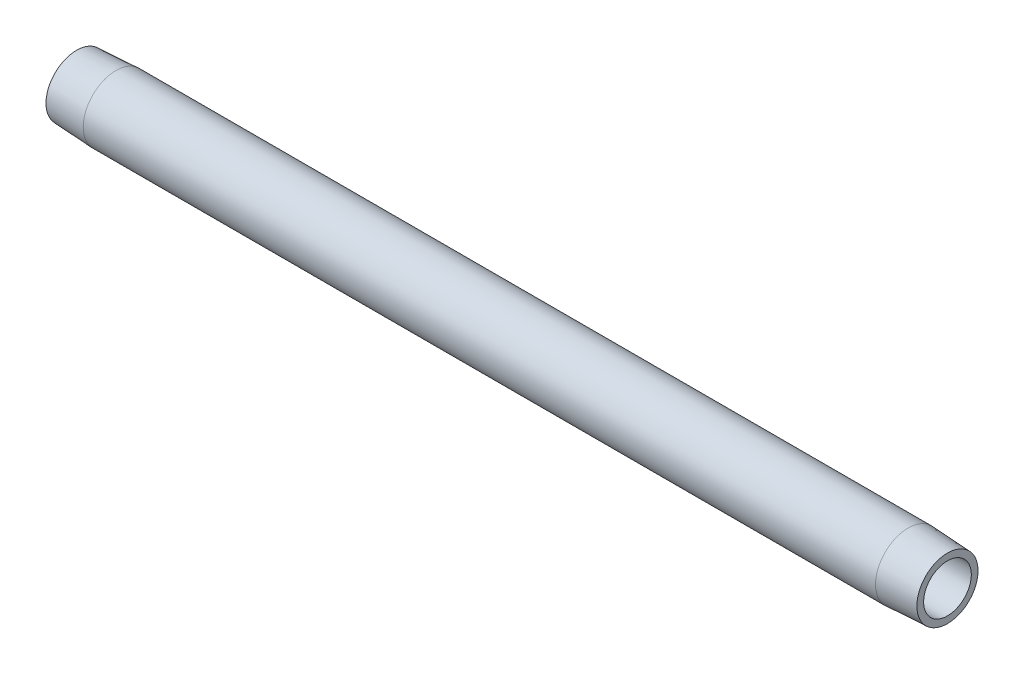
ISO-10303-21;
HEADER;
FILE_DESCRIPTION(('STEP AP214'),'2;1');
FILE_NAME('part.step','',(''),(''),'','','');
FILE_SCHEMA(('AUTOMOTIVE_DESIGN { 1 0 10303 214 1 1 1 1 }'));
ENDSEC;
DATA;
#1=APPLICATION_CONTEXT('core data for automotive mechanical design processes');
#2=APPLICATION_PROTOCOL_DEFINITION('international standard','automotive_design',2000,#1);
#3=PRODUCT_CONTEXT('',#1,'mechanical');
#4=PRODUCT('Part','Part','',(#3));
#5=PRODUCT_RELATED_PRODUCT_CATEGORY('part','',(#4));
#6=PRODUCT_DEFINITION_FORMATION('','',#4);
#7=PRODUCT_DEFINITION_CONTEXT('part definition',#1,'design');
#8=PRODUCT_DEFINITION('design','',#6,#7);
#9=PRODUCT_DEFINITION_SHAPE('','',#8);
#10=(LENGTH_UNIT() NAMED_UNIT(*) SI_UNIT(.MILLI.,.METRE.));
#11=(NAMED_UNIT(*) PLANE_ANGLE_UNIT() SI_UNIT($,.RADIAN.));
#12=(NAMED_UNIT(*) SI_UNIT($,.STERADIAN.) SOLID_ANGLE_UNIT());
#13=UNCERTAINTY_MEASURE_WITH_UNIT(LENGTH_MEASURE(1.E-05),#10,'distance_accuracy_value','');
#14=(GEOMETRIC_REPRESENTATION_CONTEXT(3) GLOBAL_UNCERTAINTY_ASSIGNED_CONTEXT((#13)) GLOBAL_UNIT_ASSIGNED_CONTEXT((#10,
#11,#12)) REPRESENTATION_CONTEXT('',''));
#15=CARTESIAN_POINT('',(0.,0.,0.));
#16=DIRECTION('',(0.,0.,1.));
#17=DIRECTION('',(1.,0.,0.));
#18=AXIS2_PLACEMENT_3D('',#15,#16,#17);
#19=CARTESIAN_POINT('',(228.6,6.26110000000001,0.));
#20=DIRECTION('',(-1.,0.,0.));
#21=DIRECTION('',(0.,0.,1.));
#22=AXIS2_PLACEMENT_3D('',#19,#20,#21);
#23=PLANE('',#22);
#24=CARTESIAN_POINT('',(228.6,0.,0.));
#25=DIRECTION('',(-1.,0.,0.));
#26=DIRECTION('',(0.,0.,1.));
#27=AXIS2_PLACEMENT_3D('',#24,#25,#26);
#28=CIRCLE('',#27,8.03205001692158);
#29=CARTESIAN_POINT('',(228.6,0.,8.03205001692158));
#30=VERTEX_POINT('',#29);
#31=EDGE_CURVE('E10',#30,#30,#28,.T.);
#32=ORIENTED_EDGE('',*,*,#31,.F.);
#33=EDGE_LOOP('',(#32));
#34=FACE_BOUND('',#33,.T.);
#35=CARTESIAN_POINT('',(228.6,0.,0.));
#36=DIRECTION('',(-1.,0.,0.));
#37=DIRECTION('',(0.,0.,1.));
#38=AXIS2_PLACEMENT_3D('',#35,#36,#37);
#39=CIRCLE('',#38,6.26110000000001);
#40=CARTESIAN_POINT('',(228.6,0.,6.26110000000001));
#41=VERTEX_POINT('',#40);
#42=EDGE_CURVE('E52',#41,#41,#39,.T.);
#43=ORIENTED_EDGE('',*,*,#42,.T.);
#44=EDGE_LOOP('',(#43));
#45=FACE_BOUND('',#44,.T.);
#46=ADVANCED_FACE('F30',(#34,#45),#23,.F.);
#47=CARTESIAN_POINT('',(228.6,0.,0.));
#48=DIRECTION('',(-1.,0.,0.));
#49=DIRECTION('',(0.,0.,1.));
#50=AXIS2_PLACEMENT_3D('',#47,#48,#49);
#51=CONICAL_SURFACE('',#50,8.03205001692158,0.0523598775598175);
#52=CARTESIAN_POINT('',(218.2876,0.,0.));
#53=DIRECTION('',(-1.,0.,0.));
#54=DIRECTION('',(0.,0.,1.));
#55=AXIS2_PLACEMENT_3D('',#52,#53,#54);
#56=CIRCLE('',#55,8.57249999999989);
#57=CARTESIAN_POINT('',(218.2876,0.,8.57249999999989));
#58=VERTEX_POINT('',#57);
#59=EDGE_CURVE('E36',#58,#58,#56,.T.);
#60=ORIENTED_EDGE('',*,*,#59,.F.);
#61=EDGE_LOOP('',(#60));
#62=FACE_BOUND('',#61,.T.);
#63=ORIENTED_EDGE('',*,*,#31,.T.);
#64=EDGE_LOOP('',(#63));
#65=FACE_BOUND('',#64,.T.);
#66=ADVANCED_FACE('F77',(#62,#65),#51,.T.);
#67=CARTESIAN_POINT('',(0.,0.,0.));
#68=DIRECTION('',(-1.,0.,0.));
#69=DIRECTION('',(0.,0.,1.));
#70=AXIS2_PLACEMENT_3D('',#67,#68,#69);
#71=CYLINDRICAL_SURFACE('',#70,8.57249999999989);
#72=CARTESIAN_POINT('',(10.3124,0.,0.));
#73=DIRECTION('',(-1.,0.,0.));
#74=DIRECTION('',(0.,0.,1.));
#75=AXIS2_PLACEMENT_3D('',#72,#73,#74);
#76=CIRCLE('',#75,8.57249999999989);
#77=CARTESIAN_POINT('',(10.3124,0.,8.57249999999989));
#78=VERTEX_POINT('',#77);
#79=EDGE_CURVE('E40',#78,#78,#76,.T.);
#80=ORIENTED_EDGE('',*,*,#79,.F.);
#81=EDGE_LOOP('',(#80));
#82=FACE_BOUND('',#81,.T.);
#83=ORIENTED_EDGE('',*,*,#59,.T.);
#84=EDGE_LOOP('',(#83));
#85=FACE_BOUND('',#84,.T.);
#86=ADVANCED_FACE('F72',(#82,#85),#71,.T.);
#87=CARTESIAN_POINT('',(10.3124,0.,0.));
#88=DIRECTION('',(1.,0.,0.));
#89=DIRECTION('',(0.,0.,-1.));
#90=AXIS2_PLACEMENT_3D('',#87,#88,#89);
#91=CONICAL_SURFACE('',#90,8.57249999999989,0.0523598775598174);
#92=CARTESIAN_POINT('',(0.,0.,0.));
#93=DIRECTION('',(-1.,0.,0.));
#94=DIRECTION('',(0.,0.,1.));
#95=AXIS2_PLACEMENT_3D('',#92,#93,#94);
#96=CIRCLE('',#95,8.03205001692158);
#97=CARTESIAN_POINT('',(0.,0.,8.03205001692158));
#98=VERTEX_POINT('',#97);
#99=EDGE_CURVE('E44',#98,#98,#96,.T.);
#100=ORIENTED_EDGE('',*,*,#99,.F.);
#101=EDGE_LOOP('',(#100));
#102=FACE_BOUND('',#101,.T.);
#103=ORIENTED_EDGE('',*,*,#79,.T.);
#104=EDGE_LOOP('',(#103));
#105=FACE_BOUND('',#104,.T.);
#106=ADVANCED_FACE('F66',(#102,#105),#91,.T.);
#107=CARTESIAN_POINT('',(0.,6.26110000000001,0.));
#108=DIRECTION('',(1.,0.,0.));
#109=DIRECTION('',(0.,0.,-1.));
#110=AXIS2_PLACEMENT_3D('',#107,#108,#109);
#111=PLANE('',#110);
#112=CARTESIAN_POINT('',(0.,0.,0.));
#113=DIRECTION('',(-1.,0.,0.));
#114=DIRECTION('',(0.,0.,1.));
#115=AXIS2_PLACEMENT_3D('',#112,#113,#114);
#116=CIRCLE('',#115,6.26110000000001);
#117=CARTESIAN_POINT('',(0.,0.,6.26110000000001));
#118=VERTEX_POINT('',#117);
#119=EDGE_CURVE('E49',#118,#118,#116,.T.);
#120=ORIENTED_EDGE('',*,*,#119,.F.);
#121=EDGE_LOOP('',(#120));
#122=FACE_BOUND('',#121,.T.);
#123=ORIENTED_EDGE('',*,*,#99,.T.);
#124=EDGE_LOOP('',(#123));
#125=FACE_BOUND('',#124,.T.);
#126=ADVANCED_FACE('F60',(#122,#125),#111,.F.);
#127=CARTESIAN_POINT('',(0.,0.,0.));
#128=DIRECTION('',(-1.,0.,0.));
#129=DIRECTION('',(0.,0.,1.));
#130=AXIS2_PLACEMENT_3D('',#127,#128,#129);
#131=CYLINDRICAL_SURFACE('',#130,6.26110000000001);
#132=ORIENTED_EDGE('',*,*,#42,.F.);
#133=EDGE_LOOP('',(#132));
#134=FACE_BOUND('',#133,.T.);
#135=ORIENTED_EDGE('',*,*,#119,.T.);
#136=EDGE_LOOP('',(#135));
#137=FACE_BOUND('',#136,.T.);
#138=ADVANCED_FACE('F57',(#134,#137),#131,.F.);
#139=CLOSED_SHELL('',(#46,#66,#86,#106,#126,#138));
#140=MANIFOLD_SOLID_BREP('B2',#139);
#141=ADVANCED_BREP_SHAPE_REPRESENTATION('',(#18,#140),#14);
#142=SHAPE_DEFINITION_REPRESENTATION(#9,#141);
ENDSEC;
END-ISO-10303-21;
